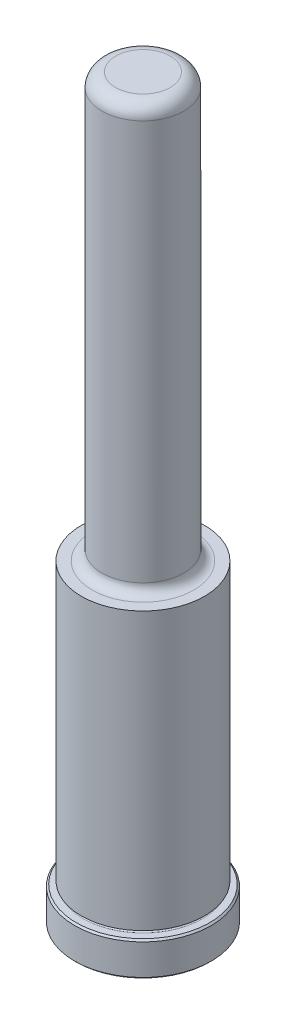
ISO-10303-21;
HEADER;
FILE_DESCRIPTION(('STEP AP214'),'2;1');
FILE_NAME('part.step','',(''),(''),'','','');
FILE_SCHEMA(('AUTOMOTIVE_DESIGN { 1 0 10303 214 1 1 1 1 }'));
ENDSEC;
DATA;
#1=APPLICATION_CONTEXT('core data for automotive mechanical design processes');
#2=APPLICATION_PROTOCOL_DEFINITION('international standard','automotive_design',2000,#1);
#3=PRODUCT_CONTEXT('',#1,'mechanical');
#4=PRODUCT('Part','Part','',(#3));
#5=PRODUCT_RELATED_PRODUCT_CATEGORY('part','',(#4));
#6=PRODUCT_DEFINITION_FORMATION('','',#4);
#7=PRODUCT_DEFINITION_CONTEXT('part definition',#1,'design');
#8=PRODUCT_DEFINITION('design','',#6,#7);
#9=PRODUCT_DEFINITION_SHAPE('','',#8);
#10=(LENGTH_UNIT() NAMED_UNIT(*) SI_UNIT(.MILLI.,.METRE.));
#11=(NAMED_UNIT(*) PLANE_ANGLE_UNIT() SI_UNIT($,.RADIAN.));
#12=(NAMED_UNIT(*) SI_UNIT($,.STERADIAN.) SOLID_ANGLE_UNIT());
#13=UNCERTAINTY_MEASURE_WITH_UNIT(LENGTH_MEASURE(1.E-05),#10,'distance_accuracy_value','');
#14=(GEOMETRIC_REPRESENTATION_CONTEXT(3) GLOBAL_UNCERTAINTY_ASSIGNED_CONTEXT((#13)) GLOBAL_UNIT_ASSIGNED_CONTEXT((#10,
#11,#12)) REPRESENTATION_CONTEXT('',''));
#15=CARTESIAN_POINT('',(0.,0.,0.));
#16=DIRECTION('',(0.,0.,1.));
#17=DIRECTION('',(1.,0.,0.));
#18=AXIS2_PLACEMENT_3D('',#15,#16,#17);
#19=CARTESIAN_POINT('',(0.,0.,0.));
#20=DIRECTION('',(0.,1.,0.));
#21=DIRECTION('',(0.,0.,1.));
#22=AXIS2_PLACEMENT_3D('',#19,#20,#21);
#23=PLANE('',#22);
#24=CARTESIAN_POINT('',(0.,0.,0.));
#25=DIRECTION('',(0.,1.,0.));
#26=DIRECTION('',(0.,0.,1.));
#27=AXIS2_PLACEMENT_3D('',#24,#25,#26);
#28=CIRCLE('',#27,15.4940000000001);
#29=CARTESIAN_POINT('',(0.,0.,15.4940000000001));
#30=VERTEX_POINT('',#29);
#31=EDGE_CURVE('E46',#30,#30,#28,.F.);
#32=ORIENTED_EDGE('',*,*,#31,.T.);
#33=EDGE_LOOP('',(#32));
#34=FACE_BOUND('',#33,.T.);
#35=ADVANCED_FACE('F31',(#34),#23,.F.);
#36=CARTESIAN_POINT('',(0.,0.,0.));
#37=DIRECTION('',(0.,1.,0.));
#38=DIRECTION('',(0.,0.,1.));
#39=AXIS2_PLACEMENT_3D('',#36,#37,#38);
#40=CYLINDRICAL_SURFACE('',#39,15.875);
#41=CARTESIAN_POINT('',(0.,0.380999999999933,0.));
#42=DIRECTION('',(0.,1.,0.));
#43=DIRECTION('',(0.,0.,1.));
#44=AXIS2_PLACEMENT_3D('',#41,#42,#43);
#45=CIRCLE('',#44,15.875);
#46=CARTESIAN_POINT('',(0.,0.380999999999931,15.875));
#47=VERTEX_POINT('',#46);
#48=EDGE_CURVE('E51',#47,#47,#45,.T.);
#49=ORIENTED_EDGE('',*,*,#48,.T.);
#50=EDGE_LOOP('',(#49));
#51=FACE_BOUND('',#50,.T.);
#52=CARTESIAN_POINT('',(0.,7.5438,0.));
#53=DIRECTION('',(0.,-1.,0.));
#54=DIRECTION('',(0.,0.,-1.));
#55=AXIS2_PLACEMENT_3D('',#52,#53,#54);
#56=CIRCLE('',#55,15.875);
#57=CARTESIAN_POINT('',(0.,7.5438,-15.875));
#58=VERTEX_POINT('',#57);
#59=EDGE_CURVE('E54',#58,#58,#56,.T.);
#60=ORIENTED_EDGE('',*,*,#59,.T.);
#61=EDGE_LOOP('',(#60));
#62=FACE_BOUND('',#61,.T.);
#63=ADVANCED_FACE('F110',(#51,#62),#40,.T.);
#64=CARTESIAN_POINT('',(0.,7.9248,-15.875));
#65=DIRECTION('',(0.,-1.,0.));
#66=DIRECTION('',(0.,0.,-1.));
#67=AXIS2_PLACEMENT_3D('',#64,#65,#66);
#68=PLANE('',#67);
#69=CARTESIAN_POINT('',(0.,7.9248,0.));
#70=DIRECTION('',(0.,-1.,0.));
#71=DIRECTION('',(0.,0.,-1.));
#72=AXIS2_PLACEMENT_3D('',#69,#70,#71);
#73=CIRCLE('',#72,15.494);
#74=CARTESIAN_POINT('',(0.,7.9248,-15.494));
#75=VERTEX_POINT('',#74);
#76=EDGE_CURVE('E42',#75,#75,#73,.F.);
#77=ORIENTED_EDGE('',*,*,#76,.T.);
#78=EDGE_LOOP('',(#77));
#79=FACE_BOUND('',#78,.T.);
#80=CARTESIAN_POINT('',(0.,7.9248,0.));
#81=DIRECTION('',(0.,1.,0.));
#82=DIRECTION('',(0.,0.,1.));
#83=AXIS2_PLACEMENT_3D('',#80,#81,#82);
#84=CIRCLE('',#83,13.8938);
#85=CARTESIAN_POINT('',(0.,7.9248,13.8938));
#86=VERTEX_POINT('',#85);
#87=EDGE_CURVE('E57',#86,#86,#84,.T.);
#88=ORIENTED_EDGE('',*,*,#87,.F.);
#89=EDGE_LOOP('',(#88));
#90=FACE_BOUND('',#89,.T.);
#91=ADVANCED_FACE('F105',(#79,#90),#68,.F.);
#92=CARTESIAN_POINT('',(0.,8.3058,0.));
#93=DIRECTION('',(0.,1.,0.));
#94=DIRECTION('',(0.,0.,1.));
#95=AXIS2_PLACEMENT_3D('',#92,#93,#94);
#96=TOROIDAL_SURFACE('',#95,13.8938,0.381000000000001);
#97=CARTESIAN_POINT('',(0.,8.68680000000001,0.));
#98=DIRECTION('',(0.,1.,0.));
#99=DIRECTION('',(0.,0.,1.));
#100=AXIS2_PLACEMENT_3D('',#97,#98,#99);
#101=CIRCLE('',#100,13.8938);
#102=CARTESIAN_POINT('',(0.,8.6868,13.8938));
#103=VERTEX_POINT('',#102);
#104=EDGE_CURVE('E60',#103,#103,#101,.T.);
#105=ORIENTED_EDGE('',*,*,#104,.F.);
#106=EDGE_LOOP('',(#105));
#107=FACE_BOUND('',#106,.T.);
#108=ORIENTED_EDGE('',*,*,#87,.T.);
#109=EDGE_LOOP('',(#108));
#110=FACE_BOUND('',#109,.T.);
#111=ADVANCED_FACE('F99',(#107,#110),#96,.F.);
#112=CARTESIAN_POINT('',(0.,8.68680000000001,-13.8938));
#113=DIRECTION('',(0.,1.,0.));
#114=DIRECTION('',(0.,0.,1.));
#115=AXIS2_PLACEMENT_3D('',#112,#113,#114);
#116=PLANE('',#115);
#117=CARTESIAN_POINT('',(0.,8.6868,0.));
#118=DIRECTION('',(0.,1.,0.));
#119=DIRECTION('',(0.,0.,1.));
#120=AXIS2_PLACEMENT_3D('',#117,#118,#119);
#121=CIRCLE('',#120,14.3002);
#122=CARTESIAN_POINT('',(0.,8.6868,14.3002));
#123=VERTEX_POINT('',#122);
#124=EDGE_CURVE('E63',#123,#123,#121,.T.);
#125=ORIENTED_EDGE('',*,*,#124,.F.);
#126=EDGE_LOOP('',(#125));
#127=FACE_BOUND('',#126,.T.);
#128=ORIENTED_EDGE('',*,*,#104,.T.);
#129=EDGE_LOOP('',(#128));
#130=FACE_BOUND('',#129,.T.);
#131=ADVANCED_FACE('F93',(#127,#130),#116,.F.);
#132=CARTESIAN_POINT('',(0.,0.,0.));
#133=DIRECTION('',(0.,1.,0.));
#134=DIRECTION('',(0.,0.,1.));
#135=AXIS2_PLACEMENT_3D('',#132,#133,#134);
#136=CYLINDRICAL_SURFACE('',#135,14.3002);
#137=CARTESIAN_POINT('',(0.,73.025,0.));
#138=DIRECTION('',(0.,1.,0.));
#139=DIRECTION('',(0.,0.,1.));
#140=AXIS2_PLACEMENT_3D('',#137,#138,#139);
#141=CIRCLE('',#140,14.3002);
#142=CARTESIAN_POINT('',(0.,73.025,14.3002));
#143=VERTEX_POINT('',#142);
#144=EDGE_CURVE('E66',#143,#143,#141,.T.);
#145=ORIENTED_EDGE('',*,*,#144,.F.);
#146=EDGE_LOOP('',(#145));
#147=FACE_BOUND('',#146,.T.);
#148=ORIENTED_EDGE('',*,*,#124,.T.);
#149=EDGE_LOOP('',(#148));
#150=FACE_BOUND('',#149,.T.);
#151=ADVANCED_FACE('F87',(#147,#150),#136,.T.);
#152=CARTESIAN_POINT('',(0.,73.025,-14.3002));
#153=DIRECTION('',(0.,-1.,0.));
#154=DIRECTION('',(0.,0.,-1.));
#155=AXIS2_PLACEMENT_3D('',#152,#153,#154);
#156=PLANE('',#155);
#157=CARTESIAN_POINT('',(0.,73.025,0.));
#158=DIRECTION('',(0.,1.,0.));
#159=DIRECTION('',(0.,0.,1.));
#160=AXIS2_PLACEMENT_3D('',#157,#158,#159);
#161=CIRCLE('',#160,11.7983);
#162=CARTESIAN_POINT('',(0.,73.025,11.7983));
#163=VERTEX_POINT('',#162);
#164=EDGE_CURVE('E69',#163,#163,#161,.T.);
#165=ORIENTED_EDGE('',*,*,#164,.F.);
#166=EDGE_LOOP('',(#165));
#167=FACE_BOUND('',#166,.T.);
#168=ORIENTED_EDGE('',*,*,#144,.T.);
#169=EDGE_LOOP('',(#168));
#170=FACE_BOUND('',#169,.T.);
#171=ADVANCED_FACE('F81',(#167,#170),#156,.F.);
#172=CARTESIAN_POINT('',(0.,75.311,0.));
#173=DIRECTION('',(0.,1.,0.));
#174=DIRECTION('',(0.,0.,1.));
#175=AXIS2_PLACEMENT_3D('',#172,#173,#174);
#176=TOROIDAL_SURFACE('',#175,11.7983,2.286);
#177=CARTESIAN_POINT('',(0.,75.311,0.));
#178=DIRECTION('',(0.,1.,0.));
#179=DIRECTION('',(0.,0.,1.));
#180=AXIS2_PLACEMENT_3D('',#177,#178,#179);
#181=CIRCLE('',#180,9.5123);
#182=CARTESIAN_POINT('',(0.,75.311,9.51230000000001));
#183=VERTEX_POINT('',#182);
#184=EDGE_CURVE('E72',#183,#183,#181,.T.);
#185=ORIENTED_EDGE('',*,*,#184,.F.);
#186=EDGE_LOOP('',(#185));
#187=FACE_BOUND('',#186,.T.);
#188=ORIENTED_EDGE('',*,*,#164,.T.);
#189=EDGE_LOOP('',(#188));
#190=FACE_BOUND('',#189,.T.);
#191=ADVANCED_FACE('F78',(#187,#190),#176,.F.);
#192=CARTESIAN_POINT('',(0.,0.,0.));
#193=DIRECTION('',(0.,1.,0.));
#194=DIRECTION('',(0.,0.,1.));
#195=AXIS2_PLACEMENT_3D('',#192,#193,#194);
#196=CYLINDRICAL_SURFACE('',#195,9.51230000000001);
#197=CARTESIAN_POINT('',(0.,168.275,0.));
#198=DIRECTION('',(0.,-1.,0.));
#199=DIRECTION('',(0.,0.,-1.));
#200=AXIS2_PLACEMENT_3D('',#197,#198,#199);
#201=CIRCLE('',#200,9.51230000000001);
#202=CARTESIAN_POINT('',(0.,168.275,-9.51229999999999));
#203=VERTEX_POINT('',#202);
#204=EDGE_CURVE('E10',#203,#203,#201,.T.);
#205=ORIENTED_EDGE('',*,*,#204,.T.);
#206=EDGE_LOOP('',(#205));
#207=FACE_BOUND('',#206,.T.);
#208=ORIENTED_EDGE('',*,*,#184,.T.);
#209=EDGE_LOOP('',(#208));
#210=FACE_BOUND('',#209,.T.);
#211=ADVANCED_FACE('F76',(#207,#210),#196,.T.);
#212=CARTESIAN_POINT('',(0.,171.45,-9.51229999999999));
#213=DIRECTION('',(0.,-1.,0.));
#214=DIRECTION('',(0.,0.,-1.));
#215=AXIS2_PLACEMENT_3D('',#212,#213,#214);
#216=PLANE('',#215);
#217=CARTESIAN_POINT('',(0.,171.45,0.));
#218=DIRECTION('',(0.,-1.,0.));
#219=DIRECTION('',(0.,0.,-1.));
#220=AXIS2_PLACEMENT_3D('',#217,#218,#219);
#221=CIRCLE('',#220,6.33730000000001);
#222=CARTESIAN_POINT('',(0.,171.45,-6.33729999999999));
#223=VERTEX_POINT('',#222);
#224=EDGE_CURVE('E38',#223,#223,#221,.F.);
#225=ORIENTED_EDGE('',*,*,#224,.T.);
#226=EDGE_LOOP('',(#225));
#227=FACE_BOUND('',#226,.T.);
#228=ADVANCED_FACE('F127',(#227),#216,.F.);
#229=CARTESIAN_POINT('',(0.,0.380999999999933,0.));
#230=DIRECTION('',(0.,1.,0.));
#231=DIRECTION('',(0.,0.,1.));
#232=AXIS2_PLACEMENT_3D('',#229,#230,#231);
#233=CONICAL_SURFACE('',#232,15.875,0.785398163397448);
#234=ORIENTED_EDGE('',*,*,#31,.F.);
#235=EDGE_LOOP('',(#234));
#236=FACE_BOUND('',#235,.T.);
#237=ORIENTED_EDGE('',*,*,#48,.F.);
#238=EDGE_LOOP('',(#237));
#239=FACE_BOUND('',#238,.T.);
#240=ADVANCED_FACE('F124',(#236,#239),#233,.T.);
#241=CARTESIAN_POINT('',(0.,7.9248,0.));
#242=DIRECTION('',(0.,-1.,0.));
#243=DIRECTION('',(0.,0.,-1.));
#244=AXIS2_PLACEMENT_3D('',#241,#242,#243);
#245=CONICAL_SURFACE('',#244,15.494,0.785398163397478);
#246=ORIENTED_EDGE('',*,*,#59,.F.);
#247=EDGE_LOOP('',(#246));
#248=FACE_BOUND('',#247,.T.);
#249=ORIENTED_EDGE('',*,*,#76,.F.);
#250=EDGE_LOOP('',(#249));
#251=FACE_BOUND('',#250,.T.);
#252=ADVANCED_FACE('F126',(#248,#251),#245,.T.);
#253=CARTESIAN_POINT('',(0.,168.275,0.));
#254=DIRECTION('',(0.,-1.,0.));
#255=DIRECTION('',(0.,0.,-1.));
#256=AXIS2_PLACEMENT_3D('',#253,#254,#255);
#257=TOROIDAL_SURFACE('',#256,6.33730000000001,3.175);
#258=ORIENTED_EDGE('',*,*,#204,.F.);
#259=EDGE_LOOP('',(#258));
#260=FACE_BOUND('',#259,.T.);
#261=ORIENTED_EDGE('',*,*,#224,.F.);
#262=EDGE_LOOP('',(#261));
#263=FACE_BOUND('',#262,.T.);
#264=ADVANCED_FACE('F33',(#260,#263),#257,.T.);
#265=CLOSED_SHELL('',(#35,#63,#91,#111,#131,#151,#171,#191,#211,#228,#240,#252,#264));
#266=MANIFOLD_SOLID_BREP('B2',#265);
#267=ADVANCED_BREP_SHAPE_REPRESENTATION('',(#18,#266),#14);
#268=SHAPE_DEFINITION_REPRESENTATION(#9,#267);
ENDSEC;
END-ISO-10303-21;
